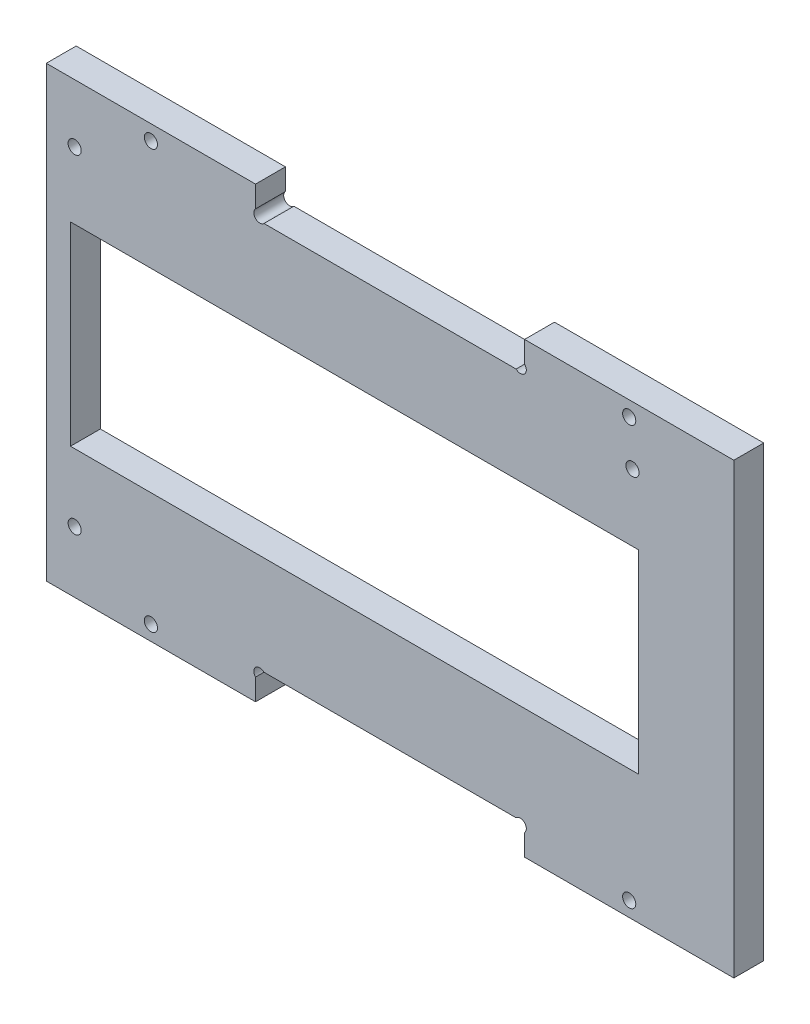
from build123d import *

# Parameters (mm, degrees)
ESQUISSE1_W               = 115
ESQUISSE1_H               = 75
BOSS_EXTRU_1_DEPTH        = 5
ENL_V_MAT_EXTRU_1_REACH   = 139.386
ESQUISSE2_W               = 95
ESQUISSE2_H               = 32.5
ENL_V_MAT_EXTRU_2_REACH   = 139.386
ESQUISSE3_R               = 1.1
ENL_V_MAT_EXTRU_4_REACH   = 139.386
ESQUISSE5_W               = 45
ESQUISSE5_H               = 5
ENL_V_START               = -5
ESQUISSE6_R               = 1
ENL_V_MAT_EXTRU_5_DEPTH   = 5
ESQUISSE7_W               = 40
ESQUISSE7_H               = 6
ENL_V_MAT_EXTRU_6_DEPTH   = 1
ENL_V_MAT_EXTRU_7_REACH   = 139.386
ESQUISSE8_R               = 1.1
SYM_TRIE2_COPY_1_REACH    = 139.386
SYM_TRIE2_COPY_1_SKETCH_R = 1.1


with BuildPart() as part:
    # Esquisse1 → Boss.-Extru.1 (new body)
    with BuildSketch(Plane.XY):
        with Locations((57.5, 37.5)):
            Rectangle(ESQUISSE1_W, ESQUISSE1_H)
    extrude(amount=BOSS_EXTRU_1_DEPTH)

    # Esquisse2 → Enl_v. mat.-Extru.1 (cut, up to next)
    with BuildSketch(Plane.XY.offset(5), mode=Mode.PRIVATE) as enl_v_mat_extru_1_sk1:
        with Locations((51.55, 37.8)):
            Rectangle(ESQUISSE2_W, ESQUISSE2_H)
    enl_v_mat_extru_1_tool1 = extrude(enl_v_mat_extru_1_sk1.sketch, amount=-ENL_V_MAT_EXTRU_1_REACH, mode=Mode.PRIVATE) & part.part
    add(enl_v_mat_extru_1_tool1.solids().sort_by_distance((51.55, 37.8, 5))[0], mode=Mode.SUBTRACT)

    # Esquisse3 → Enl_v. mat.-Extru.2 (cut, up to next)
    with BuildSketch(Plane.XY.offset(5), mode=Mode.PRIVATE) as enl_v_mat_extru_2_sk1:
        with Locations((4.75, 65.25)):
            Circle(ESQUISSE3_R)
    enl_v_mat_extru_2_tool1 = extrude(enl_v_mat_extru_2_sk1.sketch, amount=-ENL_V_MAT_EXTRU_2_REACH, mode=Mode.PRIVATE) & part.part
    # Esquisse3 → Enl_v. mat.-Extru.2 (cut, up to next)
    with BuildSketch(Plane.XY.offset(5), mode=Mode.PRIVATE) as enl_v_mat_extru_2_sk2:
        with Locations((98.05, 65.25)):
            Circle(ESQUISSE3_R)
    enl_v_mat_extru_2_tool2 = extrude(enl_v_mat_extru_2_sk2.sketch, amount=-ENL_V_MAT_EXTRU_2_REACH, mode=Mode.PRIVATE) & part.part
    # Esquisse3 → Enl_v. mat.-Extru.2 (cut, up to next)
    with BuildSketch(Plane.XY.offset(5), mode=Mode.PRIVATE) as enl_v_mat_extru_2_sk3:
        with Locations((4.75, 10.25)):
            Circle(ESQUISSE3_R)
    enl_v_mat_extru_2_tool3 = extrude(enl_v_mat_extru_2_sk3.sketch, amount=-ENL_V_MAT_EXTRU_2_REACH, mode=Mode.PRIVATE) & part.part
    add(enl_v_mat_extru_2_tool1.solids().sort_by_distance((4.75, 65.25, 5))[0], mode=Mode.SUBTRACT)
    add(enl_v_mat_extru_2_tool2.solids().sort_by_distance((98.05, 65.25, 5))[0], mode=Mode.SUBTRACT)
    add(enl_v_mat_extru_2_tool3.solids().sort_by_distance((4.75, 10.25, 5))[0], mode=Mode.SUBTRACT)

    # Esquisse5 → Enl_v. mat.-Extru.4 (cut, up to next)
    with BuildSketch(Plane.XY.offset(5), mode=Mode.PRIVATE) as enl_v_mat_extru_4_sk1:
        with Locations((57.5, 72.5)):
            Rectangle(ESQUISSE5_W, ESQUISSE5_H)
    enl_v_mat_extru_4_tool1 = extrude(enl_v_mat_extru_4_sk1.sketch, amount=-ENL_V_MAT_EXTRU_4_REACH, mode=Mode.PRIVATE) & part.part
    # Esquisse5 → Enl_v. mat.-Extru.4 (cut, up to next)
    with BuildSketch(Plane.XY.offset(5), mode=Mode.PRIVATE) as enl_v_mat_extru_4_sk2:
        with Locations((57.5, 2.5)):
            Rectangle(ESQUISSE5_W, ESQUISSE5_H)
    enl_v_mat_extru_4_tool2 = extrude(enl_v_mat_extru_4_sk2.sketch, amount=-ENL_V_MAT_EXTRU_4_REACH, mode=Mode.PRIVATE) & part.part
    add(enl_v_mat_extru_4_tool1.solids().sort_by_distance((57.5, 72.5, 5))[0], mode=Mode.SUBTRACT)
    add(enl_v_mat_extru_4_tool2.solids().sort_by_distance((57.5, 2.5, 5))[0], mode=Mode.SUBTRACT)

    # Esquisse6 → Enl_v. mat.-Extru.5 (cut)
    with BuildSketch(Plane.XY.offset(5).offset(ENL_V_START)):
        with Locations((35.707106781, 70.707106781)):
            Circle(ESQUISSE6_R)
        with Locations((79.292893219, 70.707106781)):
            Circle(ESQUISSE6_R)
        with Locations((35.707106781, 4.292893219)):
            Circle(ESQUISSE6_R)
        with Locations((79.292893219, 4.292893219)):
            Circle(ESQUISSE6_R)
    extrude(amount=ENL_V_MAT_EXTRU_5_DEPTH, mode=Mode.SUBTRACT)

    # Esquisse7 → Enl_v. mat.-Extru.6 (cut)
    with BuildSketch(Plane(origin=(0, 0, 0), x_dir=(-1, 0, 0), z_dir=(0, 0, -1))):
        with Locations((-73.05, 10.5)):
            Rectangle(ESQUISSE7_W, ESQUISSE7_H)
    extrude(amount=-ENL_V_MAT_EXTRU_6_DEPTH, mode=Mode.SUBTRACT)

    # Esquisse8 → Enl_v. mat.-Extru.7 (cut, up to next)
    with BuildSketch(Plane.XY.offset(5), mode=Mode.PRIVATE) as enl_v_mat_extru_7_sk1:
        with Locations((97.5, 72.5)):
            Circle(ESQUISSE8_R)
    enl_v_mat_extru_7_tool1 = extrude(enl_v_mat_extru_7_sk1.sketch, amount=-ENL_V_MAT_EXTRU_7_REACH, mode=Mode.PRIVATE) & part.part
    enl_v_mat_extru_7 = enl_v_mat_extru_7_tool1.solids().sort_by_distance((97.5, 72.5, 5))[0]
    add(enl_v_mat_extru_7, mode=Mode.SUBTRACT)

    # Sym_trie1: Enl_v. mat.-Extru.7 across plane
    add(enl_v_mat_extru_7.mirror(Plane.ZY.offset(-57.5)), mode=Mode.SUBTRACT)

    # Sym_trie2: Enl_v. mat.-Extru.7 across plane
    add(enl_v_mat_extru_7.mirror(Plane.ZX.offset(37.5)), mode=Mode.SUBTRACT)

    # Sym_trie2 copy 1 sketch → Sym_trie2 copy 1 (cut, up to next)
    with BuildSketch(Plane(origin=(115, 75, 5), x_dir=(-1, 0, 0), z_dir=(0, 0, 1)), mode=Mode.PRIVATE) as sym_trie2_copy_1_sk1:
        with Locations((97.5, 72.5)):
            Circle(SYM_TRIE2_COPY_1_SKETCH_R)
    sym_trie2_copy_1_tool1 = extrude(sym_trie2_copy_1_sk1.sketch, amount=-SYM_TRIE2_COPY_1_REACH, mode=Mode.PRIVATE) & part.part
    add(sym_trie2_copy_1_tool1.solids().sort_by_distance((17.5, 2.5, 5))[0], mode=Mode.SUBTRACT)


solid = part.part
